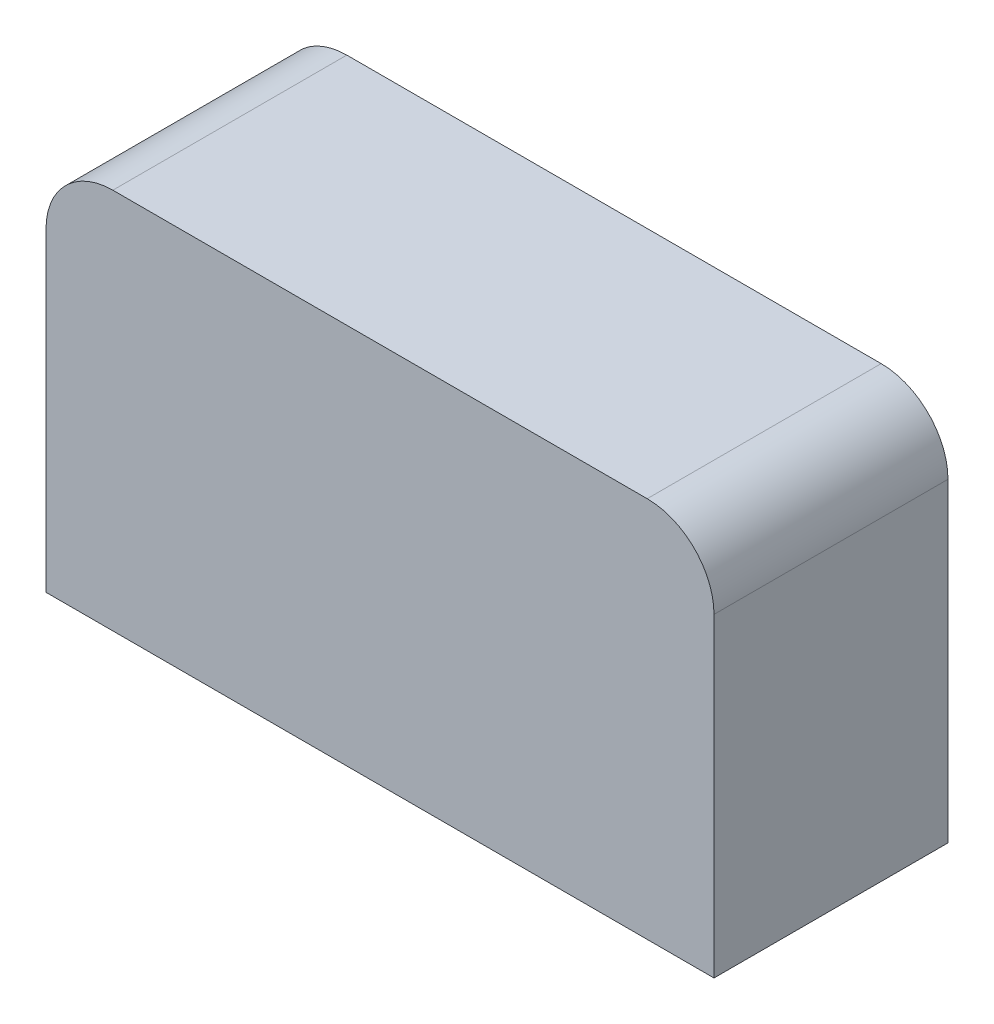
ISO-10303-21;
HEADER;
FILE_DESCRIPTION(('STEP AP214'),'2;1');
FILE_NAME('part.step','',(''),(''),'','','');
FILE_SCHEMA(('AUTOMOTIVE_DESIGN { 1 0 10303 214 1 1 1 1 }'));
ENDSEC;
DATA;
#1=APPLICATION_CONTEXT('core data for automotive mechanical design processes');
#2=APPLICATION_PROTOCOL_DEFINITION('international standard','automotive_design',2000,#1);
#3=PRODUCT_CONTEXT('',#1,'mechanical');
#4=PRODUCT('Part','Part','',(#3));
#5=PRODUCT_RELATED_PRODUCT_CATEGORY('part','',(#4));
#6=PRODUCT_DEFINITION_FORMATION('','',#4);
#7=PRODUCT_DEFINITION_CONTEXT('part definition',#1,'design');
#8=PRODUCT_DEFINITION('design','',#6,#7);
#9=PRODUCT_DEFINITION_SHAPE('','',#8);
#10=(LENGTH_UNIT() NAMED_UNIT(*) SI_UNIT(.MILLI.,.METRE.));
#11=(NAMED_UNIT(*) PLANE_ANGLE_UNIT() SI_UNIT($,.RADIAN.));
#12=(NAMED_UNIT(*) SI_UNIT($,.STERADIAN.) SOLID_ANGLE_UNIT());
#13=UNCERTAINTY_MEASURE_WITH_UNIT(LENGTH_MEASURE(1.E-05),#10,'distance_accuracy_value','');
#14=(GEOMETRIC_REPRESENTATION_CONTEXT(3) GLOBAL_UNCERTAINTY_ASSIGNED_CONTEXT((#13)) GLOBAL_UNIT_ASSIGNED_CONTEXT((#10,
#11,#12)) REPRESENTATION_CONTEXT('',''));
#15=CARTESIAN_POINT('',(0.,0.,0.));
#16=DIRECTION('',(0.,0.,1.));
#17=DIRECTION('',(1.,0.,0.));
#18=AXIS2_PLACEMENT_3D('',#15,#16,#17);
#19=CARTESIAN_POINT('',(0.,40.,24.52));
#20=DIRECTION('',(1.,0.,0.));
#21=DIRECTION('',(0.,1.,0.));
#22=AXIS2_PLACEMENT_3D('',#19,#20,#21);
#23=PLANE('',#22);
#24=DIRECTION('',(0.,-1.,0.));
#25=VECTOR('',#24,1.);
#26=CARTESIAN_POINT('',(0.,40.,24.52));
#27=LINE('',#26,#25);
#28=CARTESIAN_POINT('',(0.,33.,24.52));
#29=VERTEX_POINT('',#28);
#30=CARTESIAN_POINT('',(0.,0.,24.52));
#31=VERTEX_POINT('',#30);
#32=EDGE_CURVE('E298',#29,#31,#27,.T.);
#33=ORIENTED_EDGE('',*,*,#32,.F.);
#34=DIRECTION('',(0.,0.,-1.));
#35=VECTOR('',#34,1.);
#36=CARTESIAN_POINT('',(0.,33.,24.52));
#37=LINE('',#36,#35);
#38=CARTESIAN_POINT('',(0.,33.,0.));
#39=VERTEX_POINT('',#38);
#40=EDGE_CURVE('E333',#29,#39,#37,.T.);
#41=ORIENTED_EDGE('',*,*,#40,.T.);
#42=DIRECTION('',(0.,-1.,0.));
#43=VECTOR('',#42,1.);
#44=CARTESIAN_POINT('',(0.,40.,0.));
#45=LINE('',#44,#43);
#46=CARTESIAN_POINT('',(0.,0.,0.));
#47=VERTEX_POINT('',#46);
#48=EDGE_CURVE('E287',#39,#47,#45,.T.);
#49=ORIENTED_EDGE('',*,*,#48,.T.);
#50=DIRECTION('',(0.,0.,-1.));
#51=VECTOR('',#50,1.);
#52=CARTESIAN_POINT('',(0.,0.,24.52));
#53=LINE('',#52,#51);
#54=EDGE_CURVE('E329',#31,#47,#53,.T.);
#55=ORIENTED_EDGE('',*,*,#54,.F.);
#56=EDGE_LOOP('',(#33,#41,#49,#55));
#57=FACE_BOUND('',#56,.T.);
#58=ADVANCED_FACE('F41',(#57),#23,.F.);
#59=CARTESIAN_POINT('',(0.,0.,24.52));
#60=DIRECTION('',(0.,1.,0.));
#61=DIRECTION('',(0.,0.,1.));
#62=AXIS2_PLACEMENT_3D('',#59,#60,#61);
#63=PLANE('',#62);
#64=DIRECTION('',(1.,0.,0.));
#65=VECTOR('',#64,1.);
#66=CARTESIAN_POINT('',(0.,0.,0.));
#67=LINE('',#66,#65);
#68=CARTESIAN_POINT('',(17.,0.,0.));
#69=VERTEX_POINT('',#68);
#70=EDGE_CURVE('E316',#47,#69,#67,.T.);
#71=ORIENTED_EDGE('',*,*,#70,.T.);
#72=DIRECTION('',(0.,0.,-1.));
#73=VECTOR('',#72,1.);
#74=CARTESIAN_POINT('',(17.,0.,20.45));
#75=LINE('',#74,#73);
#76=CARTESIAN_POINT('',(17.,0.,20.45));
#77=VERTEX_POINT('',#76);
#78=EDGE_CURVE('E284',#77,#69,#75,.T.);
#79=ORIENTED_EDGE('',*,*,#78,.F.);
#80=DIRECTION('',(-1.,0.,0.));
#81=VECTOR('',#80,1.);
#82=CARTESIAN_POINT('',(53.,0.,20.45));
#83=LINE('',#82,#81);
#84=CARTESIAN_POINT('',(53.,0.,20.45));
#85=VERTEX_POINT('',#84);
#86=EDGE_CURVE('E268',#85,#77,#83,.T.);
#87=ORIENTED_EDGE('',*,*,#86,.F.);
#88=DIRECTION('',(0.,0.,-1.));
#89=VECTOR('',#88,1.);
#90=CARTESIAN_POINT('',(53.,0.,20.45));
#91=LINE('',#90,#89);
#92=CARTESIAN_POINT('',(53.,0.,0.));
#93=VERTEX_POINT('',#92);
#94=EDGE_CURVE('E288',#85,#93,#91,.T.);
#95=ORIENTED_EDGE('',*,*,#94,.T.);
#96=CARTESIAN_POINT('',(70.,0.,0.));
#97=VERTEX_POINT('',#96);
#98=EDGE_CURVE('E315',#93,#97,#67,.T.);
#99=ORIENTED_EDGE('',*,*,#98,.T.);
#100=DIRECTION('',(0.,0.,-1.));
#101=VECTOR('',#100,1.);
#102=CARTESIAN_POINT('',(70.,0.,24.52));
#103=LINE('',#102,#101);
#104=CARTESIAN_POINT('',(70.,0.,24.52));
#105=VERTEX_POINT('',#104);
#106=EDGE_CURVE('E312',#105,#97,#103,.T.);
#107=ORIENTED_EDGE('',*,*,#106,.F.);
#108=DIRECTION('',(1.,0.,0.));
#109=VECTOR('',#108,1.);
#110=CARTESIAN_POINT('',(0.,0.,24.52));
#111=LINE('',#110,#109);
#112=EDGE_CURVE('E301',#31,#105,#111,.T.);
#113=ORIENTED_EDGE('',*,*,#112,.F.);
#114=ORIENTED_EDGE('',*,*,#54,.T.);
#115=EDGE_LOOP('',(#71,#79,#87,#95,#99,#107,#113,#114));
#116=FACE_BOUND('',#115,.T.);
#117=ADVANCED_FACE('F385',(#116),#63,.F.);
#118=CARTESIAN_POINT('',(70.,40.,24.52));
#119=DIRECTION('',(-1.,0.,0.));
#120=DIRECTION('',(0.,0.,1.));
#121=AXIS2_PLACEMENT_3D('',#118,#119,#120);
#122=PLANE('',#121);
#123=DIRECTION('',(0.,1.,0.));
#124=VECTOR('',#123,1.);
#125=CARTESIAN_POINT('',(70.,40.,0.));
#126=LINE('',#125,#124);
#127=CARTESIAN_POINT('',(70.,33.,0.));
#128=VERTEX_POINT('',#127);
#129=EDGE_CURVE('E320',#97,#128,#126,.T.);
#130=ORIENTED_EDGE('',*,*,#129,.T.);
#131=DIRECTION('',(0.,0.,-1.));
#132=VECTOR('',#131,1.);
#133=CARTESIAN_POINT('',(70.,33.,24.52));
#134=LINE('',#133,#132);
#135=CARTESIAN_POINT('',(70.,33.,24.52));
#136=VERTEX_POINT('',#135);
#137=EDGE_CURVE('E50',#128,#136,#134,.F.);
#138=ORIENTED_EDGE('',*,*,#137,.T.);
#139=DIRECTION('',(0.,1.,0.));
#140=VECTOR('',#139,1.);
#141=CARTESIAN_POINT('',(70.,40.,24.52));
#142=LINE('',#141,#140);
#143=EDGE_CURVE('E305',#105,#136,#142,.T.);
#144=ORIENTED_EDGE('',*,*,#143,.F.);
#145=ORIENTED_EDGE('',*,*,#106,.T.);
#146=EDGE_LOOP('',(#130,#138,#144,#145));
#147=FACE_BOUND('',#146,.T.);
#148=ADVANCED_FACE('F358',(#147),#122,.F.);
#149=CARTESIAN_POINT('',(0.,40.,24.52));
#150=DIRECTION('',(0.,-1.,0.));
#151=DIRECTION('',(0.,0.,-1.));
#152=AXIS2_PLACEMENT_3D('',#149,#150,#151);
#153=PLANE('',#152);
#154=DIRECTION('',(-1.,0.,0.));
#155=VECTOR('',#154,1.);
#156=CARTESIAN_POINT('',(0.,40.,24.52));
#157=LINE('',#156,#155);
#158=CARTESIAN_POINT('',(63.,40.,24.52));
#159=VERTEX_POINT('',#158);
#160=CARTESIAN_POINT('',(6.99999999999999,40.,24.52));
#161=VERTEX_POINT('',#160);
#162=EDGE_CURVE('E309',#159,#161,#157,.T.);
#163=ORIENTED_EDGE('',*,*,#162,.F.);
#164=DIRECTION('',(0.,0.,-1.));
#165=VECTOR('',#164,1.);
#166=CARTESIAN_POINT('',(63.,40.,24.52));
#167=LINE('',#166,#165);
#168=CARTESIAN_POINT('',(63.,40.,0.));
#169=VERTEX_POINT('',#168);
#170=EDGE_CURVE('E348',#159,#169,#167,.T.);
#171=ORIENTED_EDGE('',*,*,#170,.T.);
#172=DIRECTION('',(-1.,0.,0.));
#173=VECTOR('',#172,1.);
#174=CARTESIAN_POINT('',(0.,40.,0.));
#175=LINE('',#174,#173);
#176=CARTESIAN_POINT('',(6.99999999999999,40.,0.));
#177=VERTEX_POINT('',#176);
#178=EDGE_CURVE('E302',#169,#177,#175,.T.);
#179=ORIENTED_EDGE('',*,*,#178,.T.);
#180=DIRECTION('',(0.,0.,-1.));
#181=VECTOR('',#180,1.);
#182=CARTESIAN_POINT('',(6.99999999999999,40.,24.52));
#183=LINE('',#182,#181);
#184=EDGE_CURVE('E341',#177,#161,#183,.F.);
#185=ORIENTED_EDGE('',*,*,#184,.T.);
#186=EDGE_LOOP('',(#163,#171,#179,#185));
#187=FACE_BOUND('',#186,.T.);
#188=ADVANCED_FACE('F370',(#187),#153,.F.);
#189=CARTESIAN_POINT('',(0.,0.,24.52));
#190=DIRECTION('',(0.,0.,1.));
#191=DIRECTION('',(1.,0.,0.));
#192=AXIS2_PLACEMENT_3D('',#189,#190,#191);
#193=PLANE('',#192);
#194=ORIENTED_EDGE('',*,*,#143,.T.);
#195=CARTESIAN_POINT('',(63.,33.,24.52));
#196=DIRECTION('',(0.,0.,1.));
#197=DIRECTION('',(1.,0.,0.));
#198=AXIS2_PLACEMENT_3D('',#195,#196,#197);
#199=CIRCLE('',#198,7.);
#200=EDGE_CURVE('E11',#136,#159,#199,.T.);
#201=ORIENTED_EDGE('',*,*,#200,.T.);
#202=ORIENTED_EDGE('',*,*,#162,.T.);
#203=CARTESIAN_POINT('',(6.99999999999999,33.,24.52));
#204=DIRECTION('',(0.,0.,1.));
#205=DIRECTION('',(1.,0.,0.));
#206=AXIS2_PLACEMENT_3D('',#203,#204,#205);
#207=CIRCLE('',#206,7.);
#208=EDGE_CURVE('E345',#161,#29,#207,.T.);
#209=ORIENTED_EDGE('',*,*,#208,.T.);
#210=ORIENTED_EDGE('',*,*,#32,.T.);
#211=ORIENTED_EDGE('',*,*,#112,.T.);
#212=EDGE_LOOP('',(#194,#201,#202,#209,#210,#211));
#213=FACE_BOUND('',#212,.T.);
#214=ADVANCED_FACE('F363',(#213),#193,.T.);
#215=CARTESIAN_POINT('',(0.,0.,0.));
#216=DIRECTION('',(0.,0.,1.));
#217=DIRECTION('',(1.,0.,0.));
#218=AXIS2_PLACEMENT_3D('',#215,#216,#217);
#219=PLANE('',#218);
#220=CARTESIAN_POINT('',(4.81499999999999,18.,0.));
#221=DIRECTION('',(0.,0.,-1.));
#222=DIRECTION('',(-1.,0.,0.));
#223=AXIS2_PLACEMENT_3D('',#220,#221,#222);
#224=CIRCLE('',#223,3.15);
#225=CARTESIAN_POINT('',(1.66499999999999,18.,0.));
#226=VERTEX_POINT('',#225);
#227=EDGE_CURVE('E244',#226,#226,#224,.T.);
#228=ORIENTED_EDGE('',*,*,#227,.F.);
#229=EDGE_LOOP('',(#228));
#230=FACE_BOUND('',#229,.T.);
#231=CARTESIAN_POINT('',(65.185,18.,0.));
#232=DIRECTION('',(0.,0.,-1.));
#233=DIRECTION('',(-1.,0.,0.));
#234=AXIS2_PLACEMENT_3D('',#231,#232,#233);
#235=CIRCLE('',#234,3.15);
#236=CARTESIAN_POINT('',(62.035,18.,0.));
#237=VERTEX_POINT('',#236);
#238=EDGE_CURVE('E243',#237,#237,#235,.T.);
#239=ORIENTED_EDGE('',*,*,#238,.F.);
#240=EDGE_LOOP('',(#239));
#241=FACE_BOUND('',#240,.T.);
#242=DIRECTION('',(0.,-1.,0.));
#243=VECTOR('',#242,1.);
#244=CARTESIAN_POINT('',(53.,36.,0.));
#245=LINE('',#244,#243);
#246=CARTESIAN_POINT('',(53.,10.5,0.));
#247=VERTEX_POINT('',#246);
#248=EDGE_CURVE('E281',#247,#93,#245,.T.);
#249=ORIENTED_EDGE('',*,*,#248,.F.);
#250=DIRECTION('',(-0.749837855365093,-0.661621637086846,0.));
#251=VECTOR('',#250,1.);
#252=CARTESIAN_POINT('',(53.,10.5,0.));
#253=LINE('',#252,#251);
#254=CARTESIAN_POINT('',(60.6501837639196,17.2501621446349,0.));
#255=VERTEX_POINT('',#254);
#256=EDGE_CURVE('E230',#255,#247,#253,.T.);
#257=ORIENTED_EDGE('',*,*,#256,.F.);
#258=CARTESIAN_POINT('',(59.9885621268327,18.,0.));
#259=DIRECTION('',(0.,0.,-1.));
#260=DIRECTION('',(1.,0.,0.));
#261=AXIS2_PLACEMENT_3D('',#258,#259,#260);
#262=CIRCLE('',#261,1.);
#263=CARTESIAN_POINT('',(60.6501837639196,18.7498378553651,0.));
#264=VERTEX_POINT('',#263);
#265=EDGE_CURVE('E396',#264,#255,#262,.T.);
#266=ORIENTED_EDGE('',*,*,#265,.F.);
#267=DIRECTION('',(0.749837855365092,-0.661621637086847,0.));
#268=VECTOR('',#267,1.);
#269=CARTESIAN_POINT('',(60.6501837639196,18.7498378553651,0.));
#270=LINE('',#269,#268);
#271=CARTESIAN_POINT('',(53.,25.5,0.));
#272=VERTEX_POINT('',#271);
#273=EDGE_CURVE('E399',#272,#264,#270,.T.);
#274=ORIENTED_EDGE('',*,*,#273,.F.);
#275=CARTESIAN_POINT('',(53.,36.,0.));
#276=VERTEX_POINT('',#275);
#277=EDGE_CURVE('E190',#276,#272,#245,.T.);
#278=ORIENTED_EDGE('',*,*,#277,.F.);
#279=DIRECTION('',(1.,0.,0.));
#280=VECTOR('',#279,1.);
#281=CARTESIAN_POINT('',(53.,36.,0.));
#282=LINE('',#281,#280);
#283=CARTESIAN_POINT('',(17.,36.,0.));
#284=VERTEX_POINT('',#283);
#285=EDGE_CURVE('E277',#284,#276,#282,.T.);
#286=ORIENTED_EDGE('',*,*,#285,.F.);
#287=DIRECTION('',(0.,1.,0.));
#288=VECTOR('',#287,1.);
#289=CARTESIAN_POINT('',(17.,36.,0.));
#290=LINE('',#289,#288);
#291=CARTESIAN_POINT('',(17.,25.5,0.));
#292=VERTEX_POINT('',#291);
#293=EDGE_CURVE('E252',#292,#284,#290,.T.);
#294=ORIENTED_EDGE('',*,*,#293,.F.);
#295=DIRECTION('',(0.749837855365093,0.661621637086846,0.));
#296=VECTOR('',#295,1.);
#297=CARTESIAN_POINT('',(17.,25.5,0.));
#298=LINE('',#297,#296);
#299=CARTESIAN_POINT('',(9.34981623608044,18.7498378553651,0.));
#300=VERTEX_POINT('',#299);
#301=EDGE_CURVE('E205',#300,#292,#298,.T.);
#302=ORIENTED_EDGE('',*,*,#301,.F.);
#303=CARTESIAN_POINT('',(10.0114378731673,18.,0.));
#304=DIRECTION('',(0.,0.,-1.));
#305=DIRECTION('',(-1.,0.,0.));
#306=AXIS2_PLACEMENT_3D('',#303,#304,#305);
#307=CIRCLE('',#306,0.999999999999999);
#308=CARTESIAN_POINT('',(9.34981623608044,17.2501621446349,0.));
#309=VERTEX_POINT('',#308);
#310=EDGE_CURVE('E219',#309,#300,#307,.T.);
#311=ORIENTED_EDGE('',*,*,#310,.F.);
#312=DIRECTION('',(-0.749837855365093,0.661621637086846,0.));
#313=VECTOR('',#312,1.);
#314=CARTESIAN_POINT('',(9.34981623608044,17.2501621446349,0.));
#315=LINE('',#314,#313);
#316=CARTESIAN_POINT('',(17.,10.5,0.));
#317=VERTEX_POINT('',#316);
#318=EDGE_CURVE('E215',#317,#309,#315,.T.);
#319=ORIENTED_EDGE('',*,*,#318,.F.);
#320=EDGE_CURVE('E273',#69,#317,#290,.T.);
#321=ORIENTED_EDGE('',*,*,#320,.F.);
#322=ORIENTED_EDGE('',*,*,#70,.F.);
#323=ORIENTED_EDGE('',*,*,#48,.F.);
#324=CARTESIAN_POINT('',(6.99999999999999,33.,0.));
#325=DIRECTION('',(0.,0.,1.));
#326=DIRECTION('',(1.,0.,0.));
#327=AXIS2_PLACEMENT_3D('',#324,#325,#326);
#328=CIRCLE('',#327,7.);
#329=EDGE_CURVE('E337',#39,#177,#328,.F.);
#330=ORIENTED_EDGE('',*,*,#329,.T.);
#331=ORIENTED_EDGE('',*,*,#178,.F.);
#332=CARTESIAN_POINT('',(63.,33.,0.));
#333=DIRECTION('',(0.,0.,1.));
#334=DIRECTION('',(1.,0.,0.));
#335=AXIS2_PLACEMENT_3D('',#332,#333,#334);
#336=CIRCLE('',#335,7.);
#337=EDGE_CURVE('E352',#169,#128,#336,.F.);
#338=ORIENTED_EDGE('',*,*,#337,.T.);
#339=ORIENTED_EDGE('',*,*,#129,.F.);
#340=ORIENTED_EDGE('',*,*,#98,.F.);
#341=EDGE_LOOP('',(#249,#257,#266,#274,#278,#286,#294,#302,#311,#319,#321,#322,#323,#330,#331,
#338,#339,#340));
#342=FACE_BOUND('',#341,.T.);
#343=ADVANCED_FACE('F373',(#230,#241,#342),#219,.F.);
#344=CARTESIAN_POINT('',(6.99999999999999,33.,24.52));
#345=DIRECTION('',(0.,0.,-1.));
#346=DIRECTION('',(-1.,0.,0.));
#347=AXIS2_PLACEMENT_3D('',#344,#345,#346);
#348=CYLINDRICAL_SURFACE('',#347,7.);
#349=ORIENTED_EDGE('',*,*,#208,.F.);
#350=ORIENTED_EDGE('',*,*,#184,.F.);
#351=ORIENTED_EDGE('',*,*,#329,.F.);
#352=ORIENTED_EDGE('',*,*,#40,.F.);
#353=EDGE_LOOP('',(#349,#350,#351,#352));
#354=FACE_BOUND('',#353,.T.);
#355=ADVANCED_FACE('F380',(#354),#348,.T.);
#356=CARTESIAN_POINT('',(63.,33.,24.52));
#357=DIRECTION('',(0.,0.,-1.));
#358=DIRECTION('',(-1.,0.,0.));
#359=AXIS2_PLACEMENT_3D('',#356,#357,#358);
#360=CYLINDRICAL_SURFACE('',#359,7.);
#361=ORIENTED_EDGE('',*,*,#200,.F.);
#362=ORIENTED_EDGE('',*,*,#137,.F.);
#363=ORIENTED_EDGE('',*,*,#337,.F.);
#364=ORIENTED_EDGE('',*,*,#170,.F.);
#365=EDGE_LOOP('',(#361,#362,#363,#364));
#366=FACE_BOUND('',#365,.T.);
#367=ADVANCED_FACE('F43',(#366),#360,.T.);
#368=CARTESIAN_POINT('',(17.,36.,20.45));
#369=DIRECTION('',(-1.,0.,0.));
#370=DIRECTION('',(0.,0.,1.));
#371=AXIS2_PLACEMENT_3D('',#368,#369,#370);
#372=PLANE('',#371);
#373=DIRECTION('',(0.,-1.,0.));
#374=VECTOR('',#373,1.);
#375=CARTESIAN_POINT('',(17.,10.5,3.));
#376=LINE('',#375,#374);
#377=CARTESIAN_POINT('',(17.,25.5,3.));
#378=VERTEX_POINT('',#377);
#379=CARTESIAN_POINT('',(17.,10.5,3.));
#380=VERTEX_POINT('',#379);
#381=EDGE_CURVE('E201',#378,#380,#376,.T.);
#382=ORIENTED_EDGE('',*,*,#381,.F.);
#383=DIRECTION('',(0.,0.,-1.));
#384=VECTOR('',#383,1.);
#385=CARTESIAN_POINT('',(17.,25.5,3.));
#386=LINE('',#385,#384);
#387=EDGE_CURVE('E226',#378,#292,#386,.T.);
#388=ORIENTED_EDGE('',*,*,#387,.T.);
#389=ORIENTED_EDGE('',*,*,#293,.T.);
#390=DIRECTION('',(0.,0.,-1.));
#391=VECTOR('',#390,1.);
#392=CARTESIAN_POINT('',(17.,36.,20.45));
#393=LINE('',#392,#391);
#394=CARTESIAN_POINT('',(17.,36.,20.45));
#395=VERTEX_POINT('',#394);
#396=EDGE_CURVE('E272',#395,#284,#393,.T.);
#397=ORIENTED_EDGE('',*,*,#396,.F.);
#398=DIRECTION('',(0.,1.,0.));
#399=VECTOR('',#398,1.);
#400=CARTESIAN_POINT('',(17.,36.,20.45));
#401=LINE('',#400,#399);
#402=EDGE_CURVE('E256',#77,#395,#401,.T.);
#403=ORIENTED_EDGE('',*,*,#402,.F.);
#404=ORIENTED_EDGE('',*,*,#78,.T.);
#405=ORIENTED_EDGE('',*,*,#320,.T.);
#406=DIRECTION('',(0.,0.,-1.));
#407=VECTOR('',#406,1.);
#408=CARTESIAN_POINT('',(17.,10.5,3.));
#409=LINE('',#408,#407);
#410=EDGE_CURVE('E214',#380,#317,#409,.T.);
#411=ORIENTED_EDGE('',*,*,#410,.F.);
#412=EDGE_LOOP('',(#382,#388,#389,#397,#403,#404,#405,#411));
#413=FACE_BOUND('',#412,.T.);
#414=ADVANCED_FACE('F435',(#413),#372,.F.);
#415=CARTESIAN_POINT('',(53.,36.,20.45));
#416=DIRECTION('',(1.,0.,0.));
#417=DIRECTION('',(0.,1.,0.));
#418=AXIS2_PLACEMENT_3D('',#415,#416,#417);
#419=PLANE('',#418);
#420=DIRECTION('',(0.,1.,0.));
#421=VECTOR('',#420,1.);
#422=CARTESIAN_POINT('',(53.,25.5,3.));
#423=LINE('',#422,#421);
#424=CARTESIAN_POINT('',(53.,10.5,3.));
#425=VERTEX_POINT('',#424);
#426=CARTESIAN_POINT('',(53.,25.5,3.));
#427=VERTEX_POINT('',#426);
#428=EDGE_CURVE('E179',#425,#427,#423,.T.);
#429=ORIENTED_EDGE('',*,*,#428,.F.);
#430=DIRECTION('',(0.,0.,-1.));
#431=VECTOR('',#430,1.);
#432=CARTESIAN_POINT('',(53.,10.5,3.));
#433=LINE('',#432,#431);
#434=EDGE_CURVE('E192',#425,#247,#433,.T.);
#435=ORIENTED_EDGE('',*,*,#434,.T.);
#436=ORIENTED_EDGE('',*,*,#248,.T.);
#437=ORIENTED_EDGE('',*,*,#94,.F.);
#438=DIRECTION('',(0.,-1.,0.));
#439=VECTOR('',#438,1.);
#440=CARTESIAN_POINT('',(53.,36.,20.45));
#441=LINE('',#440,#439);
#442=CARTESIAN_POINT('',(53.,36.,20.45));
#443=VERTEX_POINT('',#442);
#444=EDGE_CURVE('E264',#443,#85,#441,.T.);
#445=ORIENTED_EDGE('',*,*,#444,.F.);
#446=DIRECTION('',(0.,0.,-1.));
#447=VECTOR('',#446,1.);
#448=CARTESIAN_POINT('',(53.,36.,20.45));
#449=LINE('',#448,#447);
#450=EDGE_CURVE('E292',#443,#276,#449,.T.);
#451=ORIENTED_EDGE('',*,*,#450,.T.);
#452=ORIENTED_EDGE('',*,*,#277,.T.);
#453=DIRECTION('',(0.,0.,-1.));
#454=VECTOR('',#453,1.);
#455=CARTESIAN_POINT('',(53.,25.5,3.));
#456=LINE('',#455,#454);
#457=EDGE_CURVE('E173',#427,#272,#456,.T.);
#458=ORIENTED_EDGE('',*,*,#457,.F.);
#459=EDGE_LOOP('',(#429,#435,#436,#437,#445,#451,#452,#458));
#460=FACE_BOUND('',#459,.T.);
#461=ADVANCED_FACE('F188',(#460),#419,.F.);
#462=CARTESIAN_POINT('',(53.,36.,20.45));
#463=DIRECTION('',(0.,1.,0.));
#464=DIRECTION('',(0.,0.,1.));
#465=AXIS2_PLACEMENT_3D('',#462,#463,#464);
#466=PLANE('',#465);
#467=ORIENTED_EDGE('',*,*,#285,.T.);
#468=ORIENTED_EDGE('',*,*,#450,.F.);
#469=DIRECTION('',(1.,0.,0.));
#470=VECTOR('',#469,1.);
#471=CARTESIAN_POINT('',(53.,36.,20.45));
#472=LINE('',#471,#470);
#473=EDGE_CURVE('E260',#395,#443,#472,.T.);
#474=ORIENTED_EDGE('',*,*,#473,.F.);
#475=ORIENTED_EDGE('',*,*,#396,.T.);
#476=EDGE_LOOP('',(#467,#468,#474,#475));
#477=FACE_BOUND('',#476,.T.);
#478=ADVANCED_FACE('F429',(#477),#466,.F.);
#479=CARTESIAN_POINT('',(0.,0.,20.45));
#480=DIRECTION('',(0.,0.,-1.));
#481=DIRECTION('',(-1.,0.,0.));
#482=AXIS2_PLACEMENT_3D('',#479,#480,#481);
#483=PLANE('',#482);
#484=CARTESIAN_POINT('',(35.,18.,20.45));
#485=DIRECTION('',(0.,0.,-1.));
#486=DIRECTION('',(-1.,0.,0.));
#487=AXIS2_PLACEMENT_3D('',#484,#485,#486);
#488=CIRCLE('',#487,3.);
#489=CARTESIAN_POINT('',(32.,18.,20.45));
#490=VERTEX_POINT('',#489);
#491=EDGE_CURVE('E408',#490,#490,#488,.T.);
#492=ORIENTED_EDGE('',*,*,#491,.F.);
#493=EDGE_LOOP('',(#492));
#494=FACE_BOUND('',#493,.T.);
#495=ORIENTED_EDGE('',*,*,#402,.T.);
#496=ORIENTED_EDGE('',*,*,#473,.T.);
#497=ORIENTED_EDGE('',*,*,#444,.T.);
#498=ORIENTED_EDGE('',*,*,#86,.T.);
#499=EDGE_LOOP('',(#495,#496,#497,#498));
#500=FACE_BOUND('',#499,.T.);
#501=ADVANCED_FACE('F425',(#494,#500),#483,.T.);
#502=CARTESIAN_POINT('',(65.185,18.,8.));
#503=DIRECTION('',(0.,0.,-1.));
#504=DIRECTION('',(-1.,0.,0.));
#505=AXIS2_PLACEMENT_3D('',#502,#503,#504);
#506=CYLINDRICAL_SURFACE('',#505,3.15);
#507=CARTESIAN_POINT('',(65.185,18.,8.));
#508=DIRECTION('',(0.,0.,-1.));
#509=DIRECTION('',(-1.,0.,0.));
#510=AXIS2_PLACEMENT_3D('',#507,#508,#509);
#511=CIRCLE('',#510,3.15);
#512=CARTESIAN_POINT('',(62.035,18.,8.));
#513=VERTEX_POINT('',#512);
#514=EDGE_CURVE('E248',#513,#513,#511,.T.);
#515=ORIENTED_EDGE('',*,*,#514,.F.);
#516=EDGE_LOOP('',(#515));
#517=FACE_BOUND('',#516,.T.);
#518=ORIENTED_EDGE('',*,*,#238,.T.);
#519=EDGE_LOOP('',(#518));
#520=FACE_BOUND('',#519,.T.);
#521=ADVANCED_FACE('F428',(#517,#520),#506,.F.);
#522=CARTESIAN_POINT('',(65.185,18.,8.));
#523=DIRECTION('',(0.,0.,-1.));
#524=DIRECTION('',(-1.,0.,0.));
#525=AXIS2_PLACEMENT_3D('',#522,#523,#524);
#526=PLANE('',#525);
#527=ORIENTED_EDGE('',*,*,#514,.T.);
#528=EDGE_LOOP('',(#527));
#529=FACE_BOUND('',#528,.T.);
#530=ADVANCED_FACE('F526',(#529),#526,.T.);
#531=CARTESIAN_POINT('',(4.81499999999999,18.,8.));
#532=DIRECTION('',(0.,0.,-1.));
#533=DIRECTION('',(-1.,0.,0.));
#534=AXIS2_PLACEMENT_3D('',#531,#532,#533);
#535=CYLINDRICAL_SURFACE('',#534,3.15);
#536=CARTESIAN_POINT('',(4.81499999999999,18.,8.));
#537=DIRECTION('',(0.,0.,-1.));
#538=DIRECTION('',(-1.,0.,0.));
#539=AXIS2_PLACEMENT_3D('',#536,#537,#538);
#540=CIRCLE('',#539,3.15);
#541=CARTESIAN_POINT('',(1.66499999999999,18.,8.));
#542=VERTEX_POINT('',#541);
#543=EDGE_CURVE('E239',#542,#542,#540,.T.);
#544=ORIENTED_EDGE('',*,*,#543,.F.);
#545=EDGE_LOOP('',(#544));
#546=FACE_BOUND('',#545,.T.);
#547=ORIENTED_EDGE('',*,*,#227,.T.);
#548=EDGE_LOOP('',(#547));
#549=FACE_BOUND('',#548,.T.);
#550=ADVANCED_FACE('F536',(#546,#549),#535,.F.);
#551=CARTESIAN_POINT('',(4.81499999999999,18.,8.));
#552=DIRECTION('',(0.,0.,-1.));
#553=DIRECTION('',(-1.,0.,0.));
#554=AXIS2_PLACEMENT_3D('',#551,#552,#553);
#555=PLANE('',#554);
#556=ORIENTED_EDGE('',*,*,#543,.T.);
#557=EDGE_LOOP('',(#556));
#558=FACE_BOUND('',#557,.T.);
#559=ADVANCED_FACE('F452',(#558),#555,.T.);
#560=CARTESIAN_POINT('',(53.,10.5,3.));
#561=DIRECTION('',(0.661621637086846,-0.749837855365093,0.));
#562=DIRECTION('',(0.749837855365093,0.661621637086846,0.));
#563=AXIS2_PLACEMENT_3D('',#560,#561,#562);
#564=PLANE('',#563);
#565=ORIENTED_EDGE('',*,*,#256,.T.);
#566=ORIENTED_EDGE('',*,*,#434,.F.);
#567=DIRECTION('',(-0.749837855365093,-0.661621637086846,0.));
#568=VECTOR('',#567,1.);
#569=CARTESIAN_POINT('',(53.,10.5,3.));
#570=LINE('',#569,#568);
#571=CARTESIAN_POINT('',(60.6501837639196,17.2501621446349,3.));
#572=VERTEX_POINT('',#571);
#573=EDGE_CURVE('E65',#572,#425,#570,.T.);
#574=ORIENTED_EDGE('',*,*,#573,.F.);
#575=DIRECTION('',(0.,0.,-1.));
#576=VECTOR('',#575,1.);
#577=CARTESIAN_POINT('',(60.6501837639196,17.2501621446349,3.));
#578=LINE('',#577,#576);
#579=EDGE_CURVE('E196',#572,#255,#578,.T.);
#580=ORIENTED_EDGE('',*,*,#579,.T.);
#581=EDGE_LOOP('',(#565,#566,#574,#580));
#582=FACE_BOUND('',#581,.T.);
#583=ADVANCED_FACE('F441',(#582),#564,.F.);
#584=CARTESIAN_POINT('',(59.9885621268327,18.,3.));
#585=DIRECTION('',(0.,0.,-1.));
#586=DIRECTION('',(-1.,0.,0.));
#587=AXIS2_PLACEMENT_3D('',#584,#585,#586);
#588=CYLINDRICAL_SURFACE('',#587,1.);
#589=ORIENTED_EDGE('',*,*,#265,.T.);
#590=ORIENTED_EDGE('',*,*,#579,.F.);
#591=CARTESIAN_POINT('',(59.9885621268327,18.,3.));
#592=DIRECTION('',(0.,0.,-1.));
#593=DIRECTION('',(1.,0.,0.));
#594=AXIS2_PLACEMENT_3D('',#591,#592,#593);
#595=CIRCLE('',#594,1.);
#596=CARTESIAN_POINT('',(60.6501837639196,18.7498378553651,3.));
#597=VERTEX_POINT('',#596);
#598=EDGE_CURVE('E178',#597,#572,#595,.T.);
#599=ORIENTED_EDGE('',*,*,#598,.F.);
#600=DIRECTION('',(0.,0.,-1.));
#601=VECTOR('',#600,1.);
#602=CARTESIAN_POINT('',(60.6501837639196,18.7498378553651,3.));
#603=LINE('',#602,#601);
#604=EDGE_CURVE('E175',#597,#264,#603,.T.);
#605=ORIENTED_EDGE('',*,*,#604,.T.);
#606=EDGE_LOOP('',(#589,#590,#599,#605));
#607=FACE_BOUND('',#606,.T.);
#608=ADVANCED_FACE('F444',(#607),#588,.F.);
#609=CARTESIAN_POINT('',(60.6501837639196,18.7498378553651,3.));
#610=DIRECTION('',(0.661621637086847,0.749837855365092,0.));
#611=DIRECTION('',(-0.749837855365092,0.661621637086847,0.));
#612=AXIS2_PLACEMENT_3D('',#609,#610,#611);
#613=PLANE('',#612);
#614=ORIENTED_EDGE('',*,*,#273,.T.);
#615=ORIENTED_EDGE('',*,*,#604,.F.);
#616=DIRECTION('',(0.749837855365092,-0.661621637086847,0.));
#617=VECTOR('',#616,1.);
#618=CARTESIAN_POINT('',(60.6501837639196,18.7498378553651,3.));
#619=LINE('',#618,#617);
#620=EDGE_CURVE('E169',#427,#597,#619,.T.);
#621=ORIENTED_EDGE('',*,*,#620,.F.);
#622=ORIENTED_EDGE('',*,*,#457,.T.);
#623=EDGE_LOOP('',(#614,#615,#621,#622));
#624=FACE_BOUND('',#623,.T.);
#625=ADVANCED_FACE('F171',(#624),#613,.F.);
#626=CARTESIAN_POINT('',(59.9885621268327,18.,3.));
#627=DIRECTION('',(0.,0.,1.));
#628=DIRECTION('',(1.,0.,0.));
#629=AXIS2_PLACEMENT_3D('',#626,#627,#628);
#630=PLANE('',#629);
#631=ORIENTED_EDGE('',*,*,#573,.T.);
#632=ORIENTED_EDGE('',*,*,#428,.T.);
#633=ORIENTED_EDGE('',*,*,#620,.T.);
#634=ORIENTED_EDGE('',*,*,#598,.T.);
#635=EDGE_LOOP('',(#631,#632,#633,#634));
#636=FACE_BOUND('',#635,.T.);
#637=ADVANCED_FACE('F182',(#636),#630,.F.);
#638=CARTESIAN_POINT('',(17.,25.5,3.));
#639=DIRECTION('',(-0.661621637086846,0.749837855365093,0.));
#640=DIRECTION('',(-0.749837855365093,-0.661621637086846,0.));
#641=AXIS2_PLACEMENT_3D('',#638,#639,#640);
#642=PLANE('',#641);
#643=ORIENTED_EDGE('',*,*,#301,.T.);
#644=ORIENTED_EDGE('',*,*,#387,.F.);
#645=DIRECTION('',(0.749837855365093,0.661621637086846,0.));
#646=VECTOR('',#645,1.);
#647=CARTESIAN_POINT('',(17.,25.5,3.));
#648=LINE('',#647,#646);
#649=CARTESIAN_POINT('',(9.34981623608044,18.7498378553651,3.));
#650=VERTEX_POINT('',#649);
#651=EDGE_CURVE('E57',#650,#378,#648,.T.);
#652=ORIENTED_EDGE('',*,*,#651,.F.);
#653=DIRECTION('',(0.,0.,-1.));
#654=VECTOR('',#653,1.);
#655=CARTESIAN_POINT('',(9.34981623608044,18.7498378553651,3.));
#656=LINE('',#655,#654);
#657=EDGE_CURVE('E231',#650,#300,#656,.T.);
#658=ORIENTED_EDGE('',*,*,#657,.T.);
#659=EDGE_LOOP('',(#643,#644,#652,#658));
#660=FACE_BOUND('',#659,.T.);
#661=ADVANCED_FACE('F594',(#660),#642,.F.);
#662=CARTESIAN_POINT('',(10.0114378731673,18.,3.));
#663=DIRECTION('',(0.,0.,-1.));
#664=DIRECTION('',(-1.,0.,0.));
#665=AXIS2_PLACEMENT_3D('',#662,#663,#664);
#666=CYLINDRICAL_SURFACE('',#665,0.999999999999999);
#667=ORIENTED_EDGE('',*,*,#310,.T.);
#668=ORIENTED_EDGE('',*,*,#657,.F.);
#669=CARTESIAN_POINT('',(10.0114378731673,18.,3.));
#670=DIRECTION('',(0.,0.,-1.));
#671=DIRECTION('',(-1.,0.,0.));
#672=AXIS2_PLACEMENT_3D('',#669,#670,#671);
#673=CIRCLE('',#672,0.999999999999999);
#674=CARTESIAN_POINT('',(9.34981623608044,17.2501621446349,3.));
#675=VERTEX_POINT('',#674);
#676=EDGE_CURVE('E209',#675,#650,#673,.T.);
#677=ORIENTED_EDGE('',*,*,#676,.F.);
#678=DIRECTION('',(0.,0.,-1.));
#679=VECTOR('',#678,1.);
#680=CARTESIAN_POINT('',(9.34981623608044,17.2501621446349,3.));
#681=LINE('',#680,#679);
#682=EDGE_CURVE('E234',#675,#309,#681,.T.);
#683=ORIENTED_EDGE('',*,*,#682,.T.);
#684=EDGE_LOOP('',(#667,#668,#677,#683));
#685=FACE_BOUND('',#684,.T.);
#686=ADVANCED_FACE('F602',(#685),#666,.F.);
#687=CARTESIAN_POINT('',(9.34981623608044,17.2501621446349,3.));
#688=DIRECTION('',(-0.661621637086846,-0.749837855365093,0.));
#689=DIRECTION('',(0.749837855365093,-0.661621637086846,0.));
#690=AXIS2_PLACEMENT_3D('',#687,#688,#689);
#691=PLANE('',#690);
#692=ORIENTED_EDGE('',*,*,#318,.T.);
#693=ORIENTED_EDGE('',*,*,#682,.F.);
#694=DIRECTION('',(-0.749837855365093,0.661621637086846,0.));
#695=VECTOR('',#694,1.);
#696=CARTESIAN_POINT('',(9.34981623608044,17.2501621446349,3.));
#697=LINE('',#696,#695);
#698=EDGE_CURVE('E204',#380,#675,#697,.T.);
#699=ORIENTED_EDGE('',*,*,#698,.F.);
#700=ORIENTED_EDGE('',*,*,#410,.T.);
#701=EDGE_LOOP('',(#692,#693,#699,#700));
#702=FACE_BOUND('',#701,.T.);
#703=ADVANCED_FACE('F612',(#702),#691,.F.);
#704=CARTESIAN_POINT('',(10.0114378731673,18.,3.));
#705=DIRECTION('',(0.,0.,-1.));
#706=DIRECTION('',(-1.,0.,0.));
#707=AXIS2_PLACEMENT_3D('',#704,#705,#706);
#708=PLANE('',#707);
#709=ORIENTED_EDGE('',*,*,#381,.T.);
#710=ORIENTED_EDGE('',*,*,#698,.T.);
#711=ORIENTED_EDGE('',*,*,#676,.T.);
#712=ORIENTED_EDGE('',*,*,#651,.T.);
#713=EDGE_LOOP('',(#709,#710,#711,#712));
#714=FACE_BOUND('',#713,.T.);
#715=ADVANCED_FACE('F421',(#714),#708,.T.);
#716=CARTESIAN_POINT('',(35.,18.,21.45));
#717=DIRECTION('',(0.,0.,-1.));
#718=DIRECTION('',(-1.,0.,0.));
#719=AXIS2_PLACEMENT_3D('',#716,#717,#718);
#720=CYLINDRICAL_SURFACE('',#719,3.);
#721=CARTESIAN_POINT('',(35.,18.,21.45));
#722=DIRECTION('',(0.,0.,-1.));
#723=DIRECTION('',(-1.,0.,0.));
#724=AXIS2_PLACEMENT_3D('',#721,#722,#723);
#725=CIRCLE('',#724,3.);
#726=CARTESIAN_POINT('',(32.,18.,21.45));
#727=VERTEX_POINT('',#726);
#728=EDGE_CURVE('E220',#727,#727,#725,.T.);
#729=ORIENTED_EDGE('',*,*,#728,.F.);
#730=EDGE_LOOP('',(#729));
#731=FACE_BOUND('',#730,.T.);
#732=ORIENTED_EDGE('',*,*,#491,.T.);
#733=EDGE_LOOP('',(#732));
#734=FACE_BOUND('',#733,.T.);
#735=ADVANCED_FACE('F418',(#731,#734),#720,.F.);
#736=CARTESIAN_POINT('',(35.,18.,21.45));
#737=DIRECTION('',(0.,0.,-1.));
#738=DIRECTION('',(-1.,0.,0.));
#739=AXIS2_PLACEMENT_3D('',#736,#737,#738);
#740=PLANE('',#739);
#741=ORIENTED_EDGE('',*,*,#728,.T.);
#742=EDGE_LOOP('',(#741));
#743=FACE_BOUND('',#742,.T.);
#744=ADVANCED_FACE('F416',(#743),#740,.T.);
#745=CLOSED_SHELL('',(#58,#117,#148,#188,#214,#343,#355,#367,#414,#461,#478,#501,#521,#530,#550,
#559,#583,#608,#625,#637,#661,#686,#703,#715,#735,#744));
#746=MANIFOLD_SOLID_BREP('B2',#745);
#747=ADVANCED_BREP_SHAPE_REPRESENTATION('',(#18,#746),#14);
#748=SHAPE_DEFINITION_REPRESENTATION(#9,#747);
ENDSEC;
END-ISO-10303-21;
